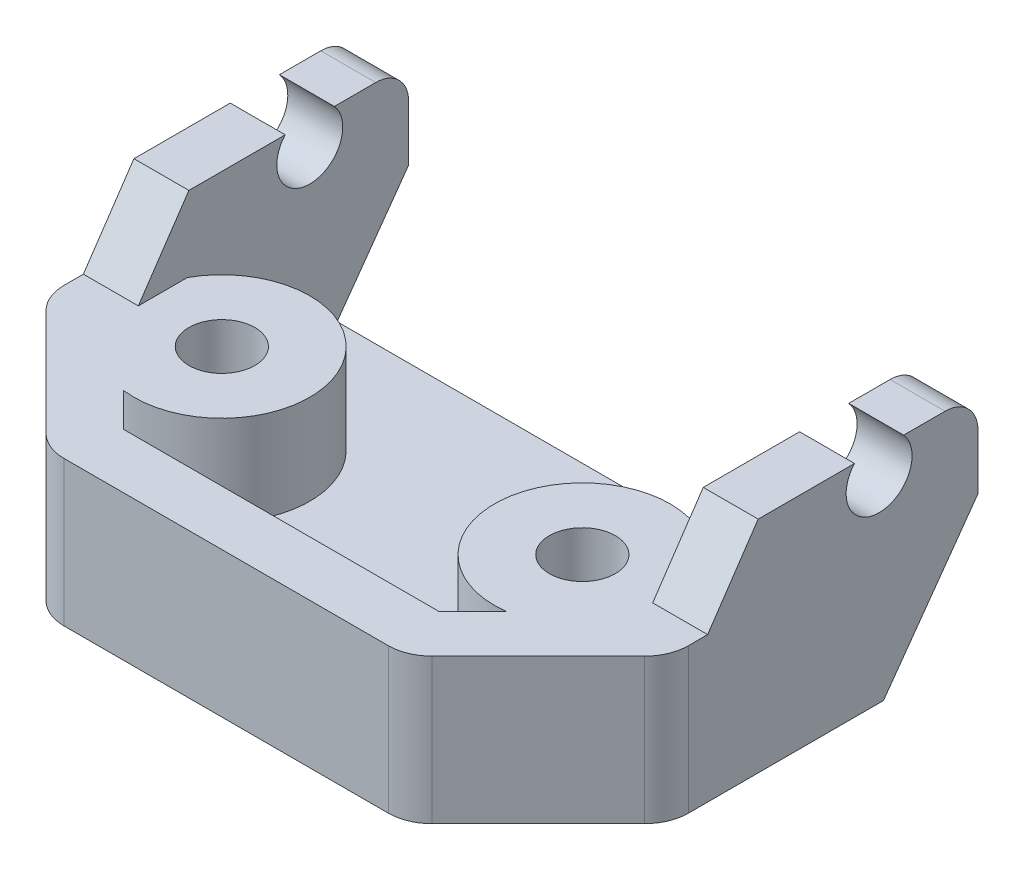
from build123d import *

# Parameters (mm, degrees)
ESQUISSE1_W             = 28.4
ESQUISSE1_H             = 20
ESQUISSE1_R             = 1.5
EXTRUSION1_DEPTH        = 10
CHANFREIN1_SIZE         = 6
CONG_1_R                = 2
COQUE1_T                = -2.5
ENL_V_MAT_EXTRU_1_DEPTH = 37.146369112
ESQUISSE3_W             = 23.4
ESQUISSE3_H             = 6.883540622
ENL_V_MAT_EXTRU_2_DEPTH = 37.146369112
ESQUISSE5_R             = 1.5
ENL_V_MAT_EXTRU_3_DEPTH = 37.146369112
ENL_V_MAT_EXTRU_4_DEPTH = 37.146369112
ESQUISSE8_W             = 23.4
ESQUISSE8_H             = 13.879160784
ENL_V_MAT_EXTRU_5_DEPTH = 3.4
CONG_2_R                = 1.5


with BuildPart() as part:
    # Esquisse1 → Extrusion1 (new body)
    with BuildSketch(Plane(origin=(0, 0, 0), x_dir=(1, 0, 0), z_dir=(0, 1, 0))):
        with Locations((14.2, 10)):
            Rectangle(ESQUISSE1_W, ESQUISSE1_H)
        with Locations(Location((22.4, 8, 0), (0, 0, 270))):
            Circle(ESQUISSE1_R, mode=Mode.SUBTRACT)
        with Locations(Location((6, 8, 0), (0, 0, 90))):
            Circle(ESQUISSE1_R, mode=Mode.SUBTRACT)
    extrude(amount=EXTRUSION1_DEPTH)

    # Chanfrein1
    chanfrein1_edges = [part.edges().sort_by_distance(p)[0] for p in [
        (28.4, 5, 0),
        (0, 5, 0),
    ]]
    chamfer(chanfrein1_edges, length=CHANFREIN1_SIZE)

    # Cong_1
    cong_1_edges = [part.edges().sort_by_distance(p)[0] for p in [
        (22.4, 5, 0),
        (6, 5, 0),
        (0, 5, -6),
        (28.4, 5, -6),
    ]]
    fillet(cong_1_edges, radius=CONG_1_R)

    # Coque1
    coque1_openings = [part.faces().sort_by_distance(p)[0] for p in [
        (14.2, 10, -10.615735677),
    ]]
    offset(amount=COQUE1_T, openings=coque1_openings, kind=Kind.INTERSECTION)

    # Esquisse2 → Enl_v. mat.-Extru.1 (cut, through all)
    with BuildSketch(Plane(origin=(28.4, 0, 0), x_dir=(0, 0, -1), z_dir=(1, 0, 0))):
        Polygon((15.7, 0), (20, 6), (21.827878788, 6), (22.212525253, -1.225858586), (15.287878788, -2.459393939), align=None)
    extrude(amount=-ENL_V_MAT_EXTRU_1_DEPTH, mode=Mode.SUBTRACT)

    # Esquisse3 → Enl_v. mat.-Extru.2 (cut, through all)
    with BuildSketch(Plane(origin=(0, 10, 0), x_dir=(-1, 0, 0), z_dir=(0, 1, 0))):
        with Locations((-14.2, -19.141770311)):
            Rectangle(ESQUISSE3_W, ESQUISSE3_H)
    extrude(amount=-ENL_V_MAT_EXTRU_2_DEPTH, mode=Mode.SUBTRACT)

    # Esquisse5 → Enl_v. mat.-Extru.3 (cut, through all)
    with BuildSketch(Plane(origin=(28.4, 0, 0), x_dir=(0, 0, -1), z_dir=(1, 0, 0))):
        with Locations((15.5, 9)):
            Circle(ESQUISSE5_R)
    extrude(amount=-ENL_V_MAT_EXTRU_3_DEPTH, mode=Mode.SUBTRACT)

    # Esquisse7 → Enl_v. mat.-Extru.4 (cut, through all)
    with BuildSketch(Plane(origin=(28.4, 0, 0), x_dir=(0, 0, -1), z_dir=(1, 0, 0))):
        Polygon((10, 10), (7.7, 6.6), (-1.806262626, 6.6), (-1.806262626, 12.946666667), (10, 12.946666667), align=None)
    extrude(amount=-ENL_V_MAT_EXTRU_4_DEPTH, mode=Mode.SUBTRACT)

    # Esquisse8 → Enl_v. mat.-Extru.5 (cut)
    with BuildSketch(Plane(origin=(0, 10, 0), x_dir=(-1, 0, 0), z_dir=(0, 1, 0))):
        with Locations((-14.2, -5.251402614)):
            Rectangle(ESQUISSE8_W, ESQUISSE8_H)
    extrude(amount=-ENL_V_MAT_EXTRU_5_DEPTH, mode=Mode.SUBTRACT)

    # Cong_2
    cong_2_edges = [part.edges().sort_by_distance(p)[0] for p in [
        (1.25, 10, -20),
        (27.15, 10, -20),
    ]]
    fillet(cong_2_edges, radius=CONG_2_R)


solid = part.part
